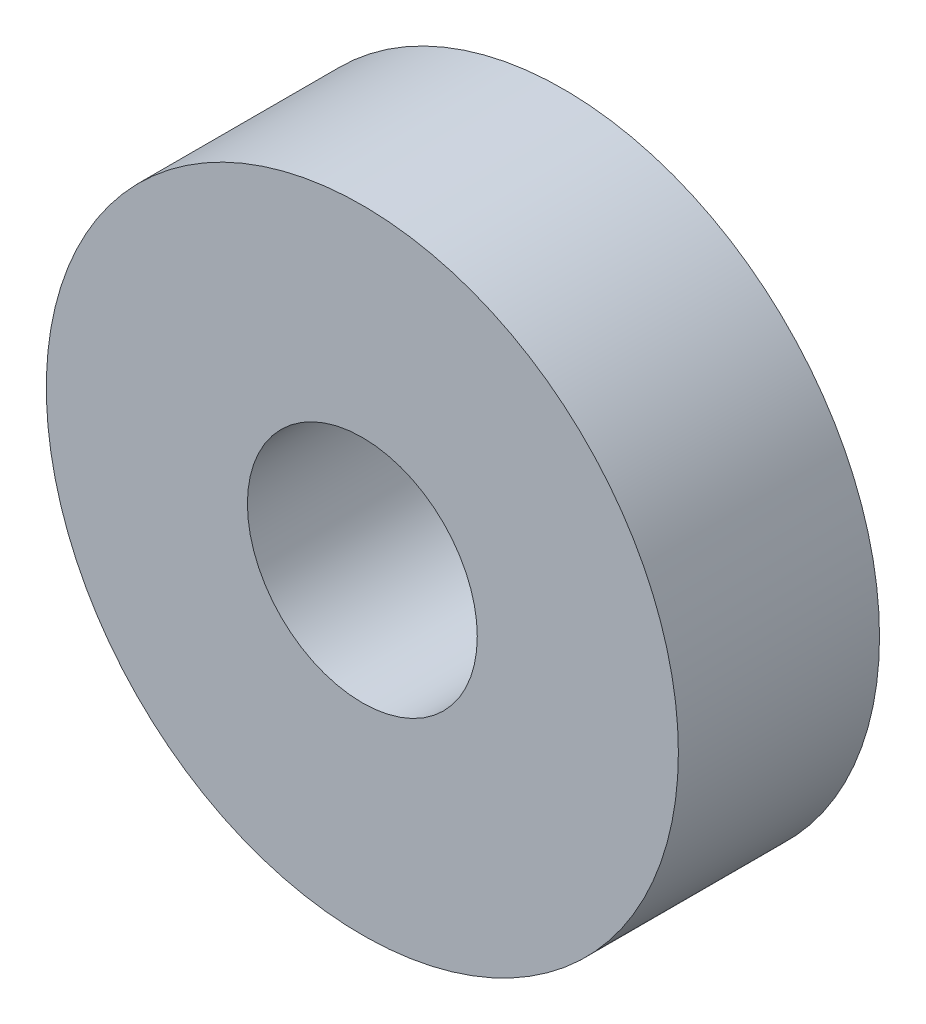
from build123d import *

# Parameters (mm, degrees)
SKETCH1_R      = 10.99947
SKETCH1_R_2    = 4.0005
EXTRUDE1_DEPTH = 7.00024


with BuildPart() as part:
    # Sketch1 → Extrude1 (new body)
    with BuildSketch(Plane.XY):
        Circle(SKETCH1_R)
        Circle(SKETCH1_R_2, mode=Mode.SUBTRACT)
    extrude(amount=EXTRUDE1_DEPTH)


solid = part.part
